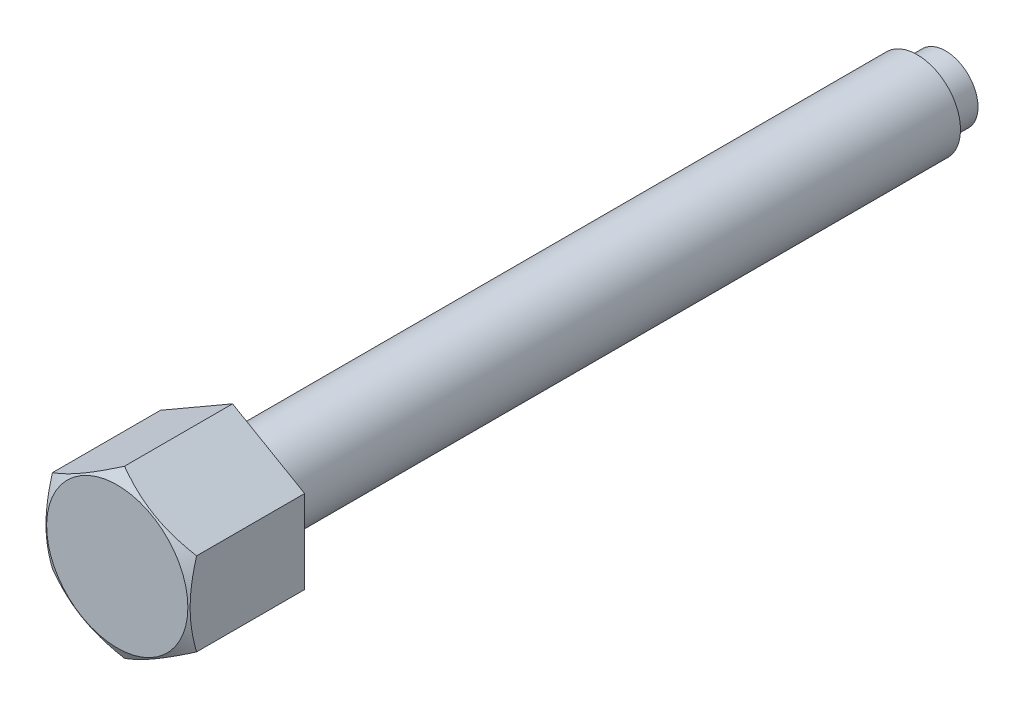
ISO-10303-21;
HEADER;
FILE_DESCRIPTION(('STEP AP214'),'2;1');
FILE_NAME('part.step','',(''),(''),'','','');
FILE_SCHEMA(('AUTOMOTIVE_DESIGN { 1 0 10303 214 1 1 1 1 }'));
ENDSEC;
DATA;
#1=APPLICATION_CONTEXT('core data for automotive mechanical design processes');
#2=APPLICATION_PROTOCOL_DEFINITION('international standard','automotive_design',2000,#1);
#3=PRODUCT_CONTEXT('',#1,'mechanical');
#4=PRODUCT('Part','Part','',(#3));
#5=PRODUCT_RELATED_PRODUCT_CATEGORY('part','',(#4));
#6=PRODUCT_DEFINITION_FORMATION('','',#4);
#7=PRODUCT_DEFINITION_CONTEXT('part definition',#1,'design');
#8=PRODUCT_DEFINITION('design','',#6,#7);
#9=PRODUCT_DEFINITION_SHAPE('','',#8);
#10=(LENGTH_UNIT() NAMED_UNIT(*) SI_UNIT(.MILLI.,.METRE.));
#11=(NAMED_UNIT(*) PLANE_ANGLE_UNIT() SI_UNIT($,.RADIAN.));
#12=(NAMED_UNIT(*) SI_UNIT($,.STERADIAN.) SOLID_ANGLE_UNIT());
#13=UNCERTAINTY_MEASURE_WITH_UNIT(LENGTH_MEASURE(1.E-05),#10,'distance_accuracy_value','');
#14=(GEOMETRIC_REPRESENTATION_CONTEXT(3) GLOBAL_UNCERTAINTY_ASSIGNED_CONTEXT((#13)) GLOBAL_UNIT_ASSIGNED_CONTEXT((#10,
#11,#12)) REPRESENTATION_CONTEXT('',''));
#15=CARTESIAN_POINT('',(0.,0.,0.));
#16=DIRECTION('',(0.,0.,1.));
#17=DIRECTION('',(1.,0.,0.));
#18=AXIS2_PLACEMENT_3D('',#15,#16,#17);
#19=CARTESIAN_POINT('',(0.,5.77350269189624,48.));
#20=DIRECTION('',(-0.5,-0.86602540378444,0.));
#21=DIRECTION('',(0.86602540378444,-0.5,0.));
#22=AXIS2_PLACEMENT_3D('',#19,#20,#21);
#23=PLANE('',#22);
#24=CARTESIAN_POINT('',(5.0002,2.88663587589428,57.4956163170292));
#25=CARTESIAN_POINT('',(4.78046540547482,3.01349970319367,57.5688784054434));
#26=CARTESIAN_POINT('',(4.55885141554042,3.14144859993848,57.635513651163));
#27=CARTESIAN_POINT('',(4.11178600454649,3.3995619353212,57.7518259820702));
#28=CARTESIAN_POINT('',(3.88632664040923,3.52973095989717,57.8014619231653));
#29=CARTESIAN_POINT('',(3.43816769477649,3.78847564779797,57.8787139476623));
#30=CARTESIAN_POINT('',(3.21553790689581,3.91701101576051,57.9068445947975));
#31=CARTESIAN_POINT('',(2.88081009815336,4.11026620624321,57.9320700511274));
#32=CARTESIAN_POINT('',(2.76915780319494,4.1747286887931,57.9376515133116));
#33=CARTESIAN_POINT('',(2.5457500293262,4.30371322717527,57.9430627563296));
#34=CARTESIAN_POINT('',(2.43399455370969,4.36823528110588,57.9428927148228));
#35=CARTESIAN_POINT('',(2.12781576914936,4.54500768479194,57.934511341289));
#36=CARTESIAN_POINT('',(1.93349391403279,4.65719946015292,57.9204352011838));
#37=CARTESIAN_POINT('',(1.5461398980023,4.8808384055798,57.8757997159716));
#38=CARTESIAN_POINT('',(1.35310909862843,4.99228478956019,57.8452251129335));
#39=CARTESIAN_POINT('',(0.96497465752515,5.21637431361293,57.7687964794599));
#40=CARTESIAN_POINT('',(0.769920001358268,5.32898917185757,57.7226185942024));
#41=CARTESIAN_POINT('',(0.382719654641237,5.55253939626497,57.6178131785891));
#42=CARTESIAN_POINT('',(0.19056900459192,5.6634776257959,57.5592102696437));
#43=CARTESIAN_POINT('',(-0.000199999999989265,5.77361816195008,57.4956163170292));
#44=B_SPLINE_CURVE_WITH_KNOTS('',3,(#24,#25,#26,#27,#28,#29,#30,#31,#32,#33,#34,#35,#36,#37,#38,
#39,#40,#41,#42,#43),.UNSPECIFIED.,.F.,.F.,(4,2,2,2,2,2,2,2,2,4),(0.,0.792555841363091,
1.58701660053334,2.36181537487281,2.74884076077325,3.13585419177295,3.80962362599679,
4.48401723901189,5.17336882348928,5.86136694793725),.UNSPECIFIED.);
#45=CARTESIAN_POINT('',(5.,2.88675134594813,57.4956829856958));
#46=VERTEX_POINT('',#45);
#47=CARTESIAN_POINT('',(0.,5.77350269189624,57.4956829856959));
#48=VERTEX_POINT('',#47);
#49=EDGE_CURVE('E29',#46,#48,#44,.T.);
#50=ORIENTED_EDGE('',*,*,#49,.F.);
#51=DIRECTION('',(0.,0.,1.));
#52=VECTOR('',#51,1.);
#53=CARTESIAN_POINT('',(5.,2.88675134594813,48.));
#54=LINE('',#53,#52);
#55=CARTESIAN_POINT('',(5.,2.88675134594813,50.));
#56=VERTEX_POINT('',#55);
#57=EDGE_CURVE('E96',#56,#46,#54,.T.);
#58=ORIENTED_EDGE('',*,*,#57,.F.);
#59=DIRECTION('',(0.86602540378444,-0.5,0.));
#60=VECTOR('',#59,1.);
#61=CARTESIAN_POINT('',(4.75,3.03108891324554,50.));
#62=LINE('',#61,#60);
#63=CARTESIAN_POINT('',(0.,5.77350269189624,50.));
#64=VERTEX_POINT('',#63);
#65=EDGE_CURVE('E110',#64,#56,#62,.T.);
#66=ORIENTED_EDGE('',*,*,#65,.F.);
#67=DIRECTION('',(0.,0.,1.));
#68=VECTOR('',#67,1.);
#69=CARTESIAN_POINT('',(0.,5.77350269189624,48.));
#70=LINE('',#69,#68);
#71=EDGE_CURVE('E36',#64,#48,#70,.T.);
#72=ORIENTED_EDGE('',*,*,#71,.T.);
#73=EDGE_LOOP('',(#50,#58,#66,#72));
#74=FACE_BOUND('',#73,.T.);
#75=ADVANCED_FACE('F14',(#74),#23,.F.);
#76=CARTESIAN_POINT('',(5.,2.88675134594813,48.));
#77=DIRECTION('',(-1.,0.,0.));
#78=DIRECTION('',(0.,-1.,0.));
#79=AXIS2_PLACEMENT_3D('',#76,#77,#78);
#80=PLANE('',#79);
#81=CARTESIAN_POINT('',(5.,-7.7556649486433,55.5014046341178));
#82=CARTESIAN_POINT('',(5.,-7.53727132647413,55.6073511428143));
#83=CARTESIAN_POINT('',(5.,-7.31837653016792,55.7122822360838));
#84=CARTESIAN_POINT('',(5.,-6.87931808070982,55.9195425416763));
#85=CARTESIAN_POINT('',(5.,-6.65915423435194,56.0218713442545));
#86=CARTESIAN_POINT('',(5.,-6.21615753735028,56.2238705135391));
#87=CARTESIAN_POINT('',(5.,-5.99331668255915,56.3235233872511));
#88=CARTESIAN_POINT('',(5.,-5.54586311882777,56.5187530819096));
#89=CARTESIAN_POINT('',(5.,-5.32125049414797,56.6143300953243));
#90=CARTESIAN_POINT('',(5.,-4.86263639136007,56.8033238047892));
#91=CARTESIAN_POINT('',(5.,-4.62856521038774,56.8965722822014));
#92=CARTESIAN_POINT('',(5.,-4.15768485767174,57.0760154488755));
#93=CARTESIAN_POINT('',(5.,-3.92087538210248,57.1622093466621));
#94=CARTESIAN_POINT('',(5.,-3.44458453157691,57.3252817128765));
#95=CARTESIAN_POINT('',(5.,-3.20510967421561,57.4021790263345));
#96=CARTESIAN_POINT('',(5.,-2.72272470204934,57.5441916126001));
#97=CARTESIAN_POINT('',(5.,-2.47981569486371,57.6093105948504));
#98=CARTESIAN_POINT('',(5.,-1.99177570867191,57.7242951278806));
#99=CARTESIAN_POINT('',(5.,-1.74666462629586,57.7742435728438));
#100=CARTESIAN_POINT('',(5.,-1.25339248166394,57.8560658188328));
#101=CARTESIAN_POINT('',(5.,-1.00523171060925,57.8879413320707));
#102=CARTESIAN_POINT('',(5.,-0.510341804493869,57.930657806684));
#103=CARTESIAN_POINT('',(5.,-0.263636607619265,57.9417692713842));
#104=CARTESIAN_POINT('',(5.,0.229835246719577,57.9427276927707));
#105=CARTESIAN_POINT('',(5.,0.476601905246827,57.9325742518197));
#106=CARTESIAN_POINT('',(5.,0.895493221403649,57.8980071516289));
#107=CARTESIAN_POINT('',(5.,1.06806584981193,57.8787113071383));
#108=CARTESIAN_POINT('',(5.,1.41194125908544,57.8309199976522));
#109=CARTESIAN_POINT('',(5.,1.58324386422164,57.8024232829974));
#110=CARTESIAN_POINT('',(5.,2.09502251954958,57.7046302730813));
#111=CARTESIAN_POINT('',(5.,2.43317693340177,57.6230490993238));
#112=CARTESIAN_POINT('',(5.,2.93880737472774,57.4816698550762));
#113=CARTESIAN_POINT('',(5.,3.10890661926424,57.4307198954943));
#114=CARTESIAN_POINT('',(5.,3.44745254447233,57.3235493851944));
#115=CARTESIAN_POINT('',(5.,3.6158992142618,57.2673287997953));
#116=CARTESIAN_POINT('',(5.,3.95119374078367,57.1505174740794));
#117=CARTESIAN_POINT('',(5.,4.11804210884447,57.0899281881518));
#118=CARTESIAN_POINT('',(5.,4.45035792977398,56.9650901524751));
#119=CARTESIAN_POINT('',(5.,4.61582539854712,56.9008414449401));
#120=CARTESIAN_POINT('',(5.,5.00518437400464,56.7454924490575));
#121=CARTESIAN_POINT('',(5.,5.22855429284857,56.6530873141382));
#122=CARTESIAN_POINT('',(5.,5.67340187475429,56.4638164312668));
#123=CARTESIAN_POINT('',(5.,5.89487942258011,56.3669504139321));
#124=CARTESIAN_POINT('',(5.,6.33628937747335,56.169651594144));
#125=CARTESIAN_POINT('',(5.,6.55622146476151,56.0692180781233));
#126=CARTESIAN_POINT('',(5.,6.99475894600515,55.8654908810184));
#127=CARTESIAN_POINT('',(5.,7.21336431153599,55.7621971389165));
#128=CARTESIAN_POINT('',(5.,7.8679853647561,55.4486366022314));
#129=CARTESIAN_POINT('',(5.,8.30233903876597,55.2349021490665));
#130=CARTESIAN_POINT('',(5.,9.16784168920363,54.8012084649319));
#131=CARTESIAN_POINT('',(5.,9.59899104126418,54.5812499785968));
#132=CARTESIAN_POINT('',(5.,10.4230640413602,54.1554511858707));
#133=CARTESIAN_POINT('',(5.,10.8161718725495,53.9499666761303));
#134=CARTESIAN_POINT('',(5.,11.6009227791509,53.5361908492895));
#135=CARTESIAN_POINT('',(5.,11.9925658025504,53.3278994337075));
#136=CARTESIAN_POINT('',(5.,12.7737356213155,52.9096956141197));
#137=CARTESIAN_POINT('',(5.,13.1632652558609,52.6997885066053));
#138=CARTESIAN_POINT('',(5.,13.9413871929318,52.2782942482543));
#139=CARTESIAN_POINT('',(5.,14.3299795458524,52.0667071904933));
#140=CARTESIAN_POINT('',(5.,14.7182266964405,51.8544931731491));
#141=B_SPLINE_CURVE_WITH_KNOTS('',3,(#81,#82,#83,#84,#85,#86,#87,#88,#89,#90,#91,#92,#93,#94,
#95,#96,#97,#98,#99,#100,#101,#102,#103,#104,#105,#106,#107,#108,#109,#110,#111,#112,#113,#114,
#115,#116,#117,#118,#119,#120,#121,#122,#123,#124,#125,#126,#127,#128,#129,#130,#131,#132,#133,
#134,#135,#136,#137,#138,#139,#140),.UNSPECIFIED.,.F.,.F.,(4,2,2,2,2,2,2,2,2,2,2,2,2,2,2,2,2,2,
2,2,2,2,2,2,2,2,2,2,2,4),(0.,0.728214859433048,1.45654367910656,2.18883515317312,
2.92109200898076,3.67688862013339,4.43276991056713,5.1870923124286,5.9411767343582,
6.69106335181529,7.44087891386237,8.18085626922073,8.92084746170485,9.44153897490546,
9.96230123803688,11.0044030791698,11.5370559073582,12.0697122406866,12.6021920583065,
13.1346657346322,13.8597869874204,14.5849520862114,15.3102630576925,16.0355895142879,
17.487780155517,18.939797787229,20.2705039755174,21.6012569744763,22.9287120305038,
24.2560940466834),.UNSPECIFIED.);
#142=CARTESIAN_POINT('',(5.,-2.88675134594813,57.4956829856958));
#143=VERTEX_POINT('',#142);
#144=EDGE_CURVE('E156',#143,#46,#141,.T.);
#145=ORIENTED_EDGE('',*,*,#144,.F.);
#146=DIRECTION('',(0.,0.,1.));
#147=VECTOR('',#146,1.);
#148=CARTESIAN_POINT('',(5.,-2.88675134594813,48.));
#149=LINE('',#148,#147);
#150=CARTESIAN_POINT('',(5.,-2.88675134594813,50.));
#151=VERTEX_POINT('',#150);
#152=EDGE_CURVE('E93',#151,#143,#149,.T.);
#153=ORIENTED_EDGE('',*,*,#152,.F.);
#154=DIRECTION('',(0.,-1.,0.));
#155=VECTOR('',#154,1.);
#156=CARTESIAN_POINT('',(5.,0.,50.));
#157=LINE('',#156,#155);
#158=EDGE_CURVE('E107',#56,#151,#157,.T.);
#159=ORIENTED_EDGE('',*,*,#158,.F.);
#160=ORIENTED_EDGE('',*,*,#57,.T.);
#161=EDGE_LOOP('',(#145,#153,#159,#160));
#162=FACE_BOUND('',#161,.T.);
#163=ADVANCED_FACE('F136',(#162),#80,.F.);
#164=CARTESIAN_POINT('',(0.,-5.77350269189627,48.));
#165=DIRECTION('',(0.5,-0.866025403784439,0.));
#166=DIRECTION('',(0.866025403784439,0.5,0.));
#167=AXIS2_PLACEMENT_3D('',#164,#165,#166);
#168=PLANE('',#167);
#169=ORIENTED_EDGE('',*,*,#152,.T.);
#170=CARTESIAN_POINT('',(5.0002,-2.88663587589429,57.4956163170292));
#171=CARTESIAN_POINT('',(4.78046540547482,-3.01349970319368,57.5688784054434));
#172=CARTESIAN_POINT('',(4.55885141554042,-3.14144859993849,57.635513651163));
#173=CARTESIAN_POINT('',(4.11178600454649,-3.39956193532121,57.7518259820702));
#174=CARTESIAN_POINT('',(3.88632664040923,-3.52973095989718,57.8014619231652));
#175=CARTESIAN_POINT('',(3.43816769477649,-3.78847564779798,57.8787139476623));
#176=CARTESIAN_POINT('',(3.21553790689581,-3.91701101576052,57.9068445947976));
#177=CARTESIAN_POINT('',(2.88081009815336,-4.11026620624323,57.9320700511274));
#178=CARTESIAN_POINT('',(2.76915780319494,-4.17472868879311,57.9376515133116));
#179=CARTESIAN_POINT('',(2.5457500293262,-4.30371322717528,57.9430627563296));
#180=CARTESIAN_POINT('',(2.43399455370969,-4.36823528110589,57.9428927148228));
#181=CARTESIAN_POINT('',(2.12781576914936,-4.54500768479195,57.934511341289));
#182=CARTESIAN_POINT('',(1.93349391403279,-4.65719946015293,57.9204352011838));
#183=CARTESIAN_POINT('',(1.54613989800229,-4.88083840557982,57.8757997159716));
#184=CARTESIAN_POINT('',(1.35310909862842,-4.99228478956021,57.8452251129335));
#185=CARTESIAN_POINT('',(0.964974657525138,-5.21637431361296,57.7687964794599));
#186=CARTESIAN_POINT('',(0.769920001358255,-5.3289891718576,57.7226185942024));
#187=CARTESIAN_POINT('',(0.38271965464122,-5.55253939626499,57.6178131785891));
#188=CARTESIAN_POINT('',(0.190569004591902,-5.66347762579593,57.5592102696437));
#189=CARTESIAN_POINT('',(-0.000200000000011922,-5.77361816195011,57.4956163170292));
#190=B_SPLINE_CURVE_WITH_KNOTS('',3,(#170,#171,#172,#173,#174,#175,#176,#177,#178,#179,#180,
#181,#182,#183,#184,#185,#186,#187,#188,#189),.UNSPECIFIED.,.F.,.F.,(4,2,2,2,2,2,2,2,2,4),(0.,
0.79255584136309,1.58701660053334,2.36181537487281,2.74884076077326,3.13585419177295,
3.8096236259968,4.4840172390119,5.1733688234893,5.86136694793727),.UNSPECIFIED.);
#191=CARTESIAN_POINT('',(0.,-5.77350269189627,57.4956829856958));
#192=VERTEX_POINT('',#191);
#193=EDGE_CURVE('E162',#143,#192,#190,.T.);
#194=ORIENTED_EDGE('',*,*,#193,.T.);
#195=DIRECTION('',(0.,0.,1.));
#196=VECTOR('',#195,1.);
#197=CARTESIAN_POINT('',(0.,-5.77350269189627,48.));
#198=LINE('',#197,#196);
#199=CARTESIAN_POINT('',(0.,-5.77350269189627,50.));
#200=VERTEX_POINT('',#199);
#201=EDGE_CURVE('E86',#200,#192,#198,.T.);
#202=ORIENTED_EDGE('',*,*,#201,.F.);
#203=DIRECTION('',(0.866025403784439,0.5,0.));
#204=VECTOR('',#203,1.);
#205=CARTESIAN_POINT('',(4.75,-3.03108891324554,50.));
#206=LINE('',#205,#204);
#207=EDGE_CURVE('E105',#200,#151,#206,.T.);
#208=ORIENTED_EDGE('',*,*,#207,.T.);
#209=EDGE_LOOP('',(#169,#194,#202,#208));
#210=FACE_BOUND('',#209,.T.);
#211=ADVANCED_FACE('F142',(#210),#168,.T.);
#212=CARTESIAN_POINT('',(0.,-5.77350269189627,48.));
#213=DIRECTION('',(0.5,0.866025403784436,0.));
#214=DIRECTION('',(-0.866025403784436,0.5,0.));
#215=AXIS2_PLACEMENT_3D('',#212,#213,#214);
#216=PLANE('',#215);
#217=CARTESIAN_POINT('',(-5.0002,-2.8866358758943,57.4956163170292));
#218=CARTESIAN_POINT('',(-4.78046540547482,-3.01349970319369,57.5688784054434));
#219=CARTESIAN_POINT('',(-4.55885141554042,-3.1414485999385,57.6355136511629));
#220=CARTESIAN_POINT('',(-4.11178600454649,-3.39956193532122,57.7518259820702));
#221=CARTESIAN_POINT('',(-3.88632664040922,-3.52973095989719,57.8014619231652));
#222=CARTESIAN_POINT('',(-3.43816769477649,-3.78847564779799,57.8787139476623));
#223=CARTESIAN_POINT('',(-3.21553790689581,-3.91701101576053,57.9068445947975));
#224=CARTESIAN_POINT('',(-2.88081009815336,-4.11026620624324,57.9320700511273));
#225=CARTESIAN_POINT('',(-2.76915780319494,-4.17472868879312,57.9376515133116));
#226=CARTESIAN_POINT('',(-2.5457500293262,-4.30371322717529,57.9430627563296));
#227=CARTESIAN_POINT('',(-2.43399455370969,-4.3682352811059,57.9428927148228));
#228=CARTESIAN_POINT('',(-2.12781576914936,-4.54500768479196,57.934511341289));
#229=CARTESIAN_POINT('',(-1.93349391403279,-4.65719946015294,57.9204352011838));
#230=CARTESIAN_POINT('',(-1.5461398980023,-4.88083840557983,57.8757997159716));
#231=CARTESIAN_POINT('',(-1.35310909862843,-4.99228478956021,57.8452251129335));
#232=CARTESIAN_POINT('',(-0.964974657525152,-5.21637431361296,57.7687964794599));
#233=CARTESIAN_POINT('',(-0.769920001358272,-5.3289891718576,57.7226185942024));
#234=CARTESIAN_POINT('',(-0.382719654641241,-5.55253939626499,57.6178131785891));
#235=CARTESIAN_POINT('',(-0.190569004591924,-5.66347762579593,57.5592102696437));
#236=CARTESIAN_POINT('',(0.000199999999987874,-5.77361816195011,57.4956163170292));
#237=B_SPLINE_CURVE_WITH_KNOTS('',3,(#217,#218,#219,#220,#221,#222,#223,#224,#225,#226,#227,
#228,#229,#230,#231,#232,#233,#234,#235,#236),.UNSPECIFIED.,.F.,.F.,(4,2,2,2,2,2,2,2,2,4),(0.,
0.792555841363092,1.58701660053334,2.36181537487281,2.74884076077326,3.13585419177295,
3.80962362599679,4.48401723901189,5.17336882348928,5.86136694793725),.UNSPECIFIED.);
#238=CARTESIAN_POINT('',(-5.,-2.88675134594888,57.4956829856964));
#239=VERTEX_POINT('',#238);
#240=EDGE_CURVE('E80',#239,#192,#237,.T.);
#241=ORIENTED_EDGE('',*,*,#240,.F.);
#242=DIRECTION('',(0.,0.,1.));
#243=VECTOR('',#242,1.);
#244=CARTESIAN_POINT('',(-5.,-2.88675134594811,48.));
#245=LINE('',#244,#243);
#246=CARTESIAN_POINT('',(-5.,-2.88675134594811,50.));
#247=VERTEX_POINT('',#246);
#248=EDGE_CURVE('E79',#247,#239,#245,.T.);
#249=ORIENTED_EDGE('',*,*,#248,.F.);
#250=DIRECTION('',(-0.866025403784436,0.5,0.));
#251=VECTOR('',#250,1.);
#252=CARTESIAN_POINT('',(-0.250000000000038,-5.62916512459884,50.));
#253=LINE('',#252,#251);
#254=EDGE_CURVE('E102',#200,#247,#253,.T.);
#255=ORIENTED_EDGE('',*,*,#254,.F.);
#256=ORIENTED_EDGE('',*,*,#201,.T.);
#257=EDGE_LOOP('',(#241,#249,#255,#256));
#258=FACE_BOUND('',#257,.T.);
#259=ADVANCED_FACE('F238',(#258),#216,.F.);
#260=CARTESIAN_POINT('',(-5.,2.88675134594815,48.));
#261=DIRECTION('',(-1.,0.,0.));
#262=DIRECTION('',(0.,-1.,0.));
#263=AXIS2_PLACEMENT_3D('',#260,#261,#262);
#264=PLANE('',#263);
#265=ORIENTED_EDGE('',*,*,#248,.T.);
#266=CARTESIAN_POINT('',(-5.,-7.75566494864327,55.5014046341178));
#267=CARTESIAN_POINT('',(-5.,-7.5372713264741,55.6073511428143));
#268=CARTESIAN_POINT('',(-5.,-7.31837653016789,55.7122822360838));
#269=CARTESIAN_POINT('',(-5.,-6.8793180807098,55.9195425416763));
#270=CARTESIAN_POINT('',(-5.,-6.65915423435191,56.0218713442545));
#271=CARTESIAN_POINT('',(-5.,-6.21615753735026,56.2238705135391));
#272=CARTESIAN_POINT('',(-5.,-5.99331668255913,56.3235233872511));
#273=CARTESIAN_POINT('',(-5.,-5.54586311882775,56.5187530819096));
#274=CARTESIAN_POINT('',(-5.,-5.32125049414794,56.6143300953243));
#275=CARTESIAN_POINT('',(-5.,-4.86263639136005,56.8033238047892));
#276=CARTESIAN_POINT('',(-5.,-4.62856521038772,56.8965722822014));
#277=CARTESIAN_POINT('',(-5.,-4.15768485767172,57.0760154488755));
#278=CARTESIAN_POINT('',(-5.,-3.92087538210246,57.1622093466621));
#279=CARTESIAN_POINT('',(-5.,-3.44458453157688,57.3252817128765));
#280=CARTESIAN_POINT('',(-5.,-3.20510967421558,57.4021790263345));
#281=CARTESIAN_POINT('',(-5.,-2.72272470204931,57.5441916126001));
#282=CARTESIAN_POINT('',(-5.,-2.47981569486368,57.6093105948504));
#283=CARTESIAN_POINT('',(-5.,-1.9917757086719,57.7242951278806));
#284=CARTESIAN_POINT('',(-5.,-1.74666462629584,57.7742435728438));
#285=CARTESIAN_POINT('',(-5.,-1.25339248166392,57.8560658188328));
#286=CARTESIAN_POINT('',(-5.,-1.00523171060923,57.8879413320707));
#287=CARTESIAN_POINT('',(-5.,-0.510341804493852,57.930657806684));
#288=CARTESIAN_POINT('',(-5.,-0.26363660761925,57.9417692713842));
#289=CARTESIAN_POINT('',(-5.,0.229835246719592,57.9427276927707));
#290=CARTESIAN_POINT('',(-5.,0.476601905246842,57.9325742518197));
#291=CARTESIAN_POINT('',(-5.,0.895493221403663,57.8980071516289));
#292=CARTESIAN_POINT('',(-5.,1.06806584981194,57.8787113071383));
#293=CARTESIAN_POINT('',(-5.,1.41194125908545,57.8309199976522));
#294=CARTESIAN_POINT('',(-5.,1.58324386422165,57.8024232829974));
#295=CARTESIAN_POINT('',(-5.,2.0950225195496,57.7046302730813));
#296=CARTESIAN_POINT('',(-5.,2.43317693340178,57.6230490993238));
#297=CARTESIAN_POINT('',(-5.,2.93880737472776,57.4816698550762));
#298=CARTESIAN_POINT('',(-5.,3.10890661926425,57.4307198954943));
#299=CARTESIAN_POINT('',(-5.,3.44745254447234,57.3235493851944));
#300=CARTESIAN_POINT('',(-5.,3.61589921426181,57.2673287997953));
#301=CARTESIAN_POINT('',(-5.,3.95119374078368,57.1505174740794));
#302=CARTESIAN_POINT('',(-5.,4.11804210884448,57.0899281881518));
#303=CARTESIAN_POINT('',(-5.,4.450357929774,56.9650901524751));
#304=CARTESIAN_POINT('',(-5.,4.61582539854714,56.9008414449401));
#305=CARTESIAN_POINT('',(-5.,5.00518437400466,56.7454924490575));
#306=CARTESIAN_POINT('',(-5.,5.22855429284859,56.6530873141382));
#307=CARTESIAN_POINT('',(-5.,5.67340187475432,56.4638164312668));
#308=CARTESIAN_POINT('',(-5.,5.89487942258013,56.3669504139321));
#309=CARTESIAN_POINT('',(-5.,6.33628937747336,56.169651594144));
#310=CARTESIAN_POINT('',(-5.,6.55622146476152,56.0692180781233));
#311=CARTESIAN_POINT('',(-5.,6.99475894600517,55.8654908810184));
#312=CARTESIAN_POINT('',(-5.,7.21336431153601,55.7621971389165));
#313=CARTESIAN_POINT('',(-5.,7.86798536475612,55.4486366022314));
#314=CARTESIAN_POINT('',(-5.,8.30233903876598,55.2349021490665));
#315=CARTESIAN_POINT('',(-5.,9.16784168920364,54.8012084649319));
#316=CARTESIAN_POINT('',(-5.,9.59899104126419,54.5812499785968));
#317=CARTESIAN_POINT('',(-5.,10.4230640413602,54.1554511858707));
#318=CARTESIAN_POINT('',(-5.,10.8161718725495,53.9499666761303));
#319=CARTESIAN_POINT('',(-5.,11.6009227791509,53.5361908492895));
#320=CARTESIAN_POINT('',(-5.,11.9925658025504,53.3278994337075));
#321=CARTESIAN_POINT('',(-5.,12.7737356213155,52.9096956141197));
#322=CARTESIAN_POINT('',(-5.,13.1632652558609,52.6997885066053));
#323=CARTESIAN_POINT('',(-5.,13.9413871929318,52.2782942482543));
#324=CARTESIAN_POINT('',(-5.,14.3299795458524,52.0667071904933));
#325=CARTESIAN_POINT('',(-5.,14.7182266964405,51.8544931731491));
#326=B_SPLINE_CURVE_WITH_KNOTS('',3,(#266,#267,#268,#269,#270,#271,#272,#273,#274,#275,#276,
#277,#278,#279,#280,#281,#282,#283,#284,#285,#286,#287,#288,#289,#290,#291,#292,#293,#294,#295,
#296,#297,#298,#299,#300,#301,#302,#303,#304,#305,#306,#307,#308,#309,#310,#311,#312,#313,#314,
#315,#316,#317,#318,#319,#320,#321,#322,#323,#324,#325),.UNSPECIFIED.,.F.,.F.,(4,2,2,2,2,2,2,2,
2,2,2,2,2,2,2,2,2,2,2,2,2,2,2,2,2,2,2,2,2,4),(0.,0.728214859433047,1.45654367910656,
2.18883515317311,2.92109200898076,3.67688862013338,4.43276991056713,5.18709231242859,
5.94117673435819,6.69106335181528,7.44087891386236,8.18085626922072,8.92084746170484,
9.44153897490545,9.96230123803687,11.0044030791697,11.5370559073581,12.0697122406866,
12.6021920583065,13.1346657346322,13.8597869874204,14.5849520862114,15.3102630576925,
16.0355895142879,17.487780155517,18.939797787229,20.2705039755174,21.6012569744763,
22.9287120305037,24.2560940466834),.UNSPECIFIED.);
#327=CARTESIAN_POINT('',(-5.,2.88675134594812,57.4956829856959));
#328=VERTEX_POINT('',#327);
#329=EDGE_CURVE('E67',#239,#328,#326,.T.);
#330=ORIENTED_EDGE('',*,*,#329,.T.);
#331=DIRECTION('',(0.,0.,1.));
#332=VECTOR('',#331,1.);
#333=CARTESIAN_POINT('',(-5.,2.88675134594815,48.));
#334=LINE('',#333,#332);
#335=CARTESIAN_POINT('',(-5.,2.88675134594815,50.));
#336=VERTEX_POINT('',#335);
#337=EDGE_CURVE('E76',#336,#328,#334,.T.);
#338=ORIENTED_EDGE('',*,*,#337,.F.);
#339=DIRECTION('',(0.,-1.,0.));
#340=VECTOR('',#339,1.);
#341=CARTESIAN_POINT('',(-5.,0.,50.));
#342=LINE('',#341,#340);
#343=EDGE_CURVE('E100',#336,#247,#342,.T.);
#344=ORIENTED_EDGE('',*,*,#343,.T.);
#345=EDGE_LOOP('',(#265,#330,#338,#344));
#346=FACE_BOUND('',#345,.T.);
#347=ADVANCED_FACE('F75',(#346),#264,.T.);
#348=CARTESIAN_POINT('',(0.,5.77350269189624,48.));
#349=DIRECTION('',(-0.5,0.866025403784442,0.));
#350=DIRECTION('',(-0.866025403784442,-0.5,0.));
#351=AXIS2_PLACEMENT_3D('',#348,#349,#350);
#352=PLANE('',#351);
#353=ORIENTED_EDGE('',*,*,#337,.T.);
#354=CARTESIAN_POINT('',(-5.0002,2.88663587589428,57.4956163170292));
#355=CARTESIAN_POINT('',(-4.78046540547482,3.01349970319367,57.5688784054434));
#356=CARTESIAN_POINT('',(-4.55885141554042,3.14144859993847,57.635513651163));
#357=CARTESIAN_POINT('',(-4.11178600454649,3.39956193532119,57.7518259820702));
#358=CARTESIAN_POINT('',(-3.88632664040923,3.52973095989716,57.8014619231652));
#359=CARTESIAN_POINT('',(-3.43816769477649,3.78847564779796,57.8787139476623));
#360=CARTESIAN_POINT('',(-3.21553790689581,3.9170110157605,57.9068445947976));
#361=CARTESIAN_POINT('',(-2.88081009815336,4.1102662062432,57.9320700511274));
#362=CARTESIAN_POINT('',(-2.76915780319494,4.17472868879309,57.9376515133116));
#363=CARTESIAN_POINT('',(-2.54575002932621,4.30371322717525,57.9430627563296));
#364=CARTESIAN_POINT('',(-2.43399455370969,4.36823528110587,57.9428927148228));
#365=CARTESIAN_POINT('',(-2.12781576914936,4.54500768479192,57.934511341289));
#366=CARTESIAN_POINT('',(-1.93349391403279,4.6571994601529,57.9204352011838));
#367=CARTESIAN_POINT('',(-1.54613989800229,4.88083840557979,57.8757997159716));
#368=CARTESIAN_POINT('',(-1.35310909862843,4.99228478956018,57.8452251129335));
#369=CARTESIAN_POINT('',(-0.964974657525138,5.21637431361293,57.7687964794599));
#370=CARTESIAN_POINT('',(-0.769920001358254,5.32898917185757,57.7226185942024));
#371=CARTESIAN_POINT('',(-0.382719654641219,5.55253939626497,57.6178131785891));
#372=CARTESIAN_POINT('',(-0.190569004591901,5.6634776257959,57.5592102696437));
#373=CARTESIAN_POINT('',(0.000200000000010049,5.77361816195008,57.4956163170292));
#374=B_SPLINE_CURVE_WITH_KNOTS('',3,(#354,#355,#356,#357,#358,#359,#360,#361,#362,#363,#364,
#365,#366,#367,#368,#369,#370,#371,#372,#373),.UNSPECIFIED.,.F.,.F.,(4,2,2,2,2,2,2,2,2,4),(0.,
0.792555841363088,1.58701660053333,2.3618153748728,2.74884076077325,3.13585419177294,
3.80962362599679,4.4840172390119,5.1733688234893,5.86136694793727),.UNSPECIFIED.);
#375=EDGE_CURVE('E64',#328,#48,#374,.T.);
#376=ORIENTED_EDGE('',*,*,#375,.T.);
#377=ORIENTED_EDGE('',*,*,#71,.F.);
#378=DIRECTION('',(-0.866025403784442,-0.5,0.));
#379=VECTOR('',#378,1.);
#380=CARTESIAN_POINT('',(-0.249999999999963,5.62916512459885,50.));
#381=LINE('',#380,#379);
#382=EDGE_CURVE('E84',#64,#336,#381,.T.);
#383=ORIENTED_EDGE('',*,*,#382,.T.);
#384=EDGE_LOOP('',(#353,#376,#377,#383));
#385=FACE_BOUND('',#384,.T.);
#386=ADVANCED_FACE('F82',(#385),#352,.T.);
#387=CARTESIAN_POINT('',(0.,0.,5.));
#388=DIRECTION('',(0.,0.,1.));
#389=DIRECTION('',(1.,0.,0.));
#390=AXIS2_PLACEMENT_3D('',#387,#388,#389);
#391=SPHERICAL_SURFACE('',#390,5.);
#392=CARTESIAN_POINT('',(0.,0.,0.53485722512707));
#393=DIRECTION('',(0.,0.,1.));
#394=DIRECTION('',(1.,0.,0.));
#395=AXIS2_PLACEMENT_3D('',#392,#393,#394);
#396=CIRCLE('',#395,2.25);
#397=CARTESIAN_POINT('',(2.25,0.,0.53485722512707));
#398=VERTEX_POINT('',#397);
#399=EDGE_CURVE('E9',#398,#398,#396,.T.);
#400=ORIENTED_EDGE('',*,*,#399,.F.);
#401=EDGE_LOOP('',(#400));
#402=FACE_BOUND('',#401,.T.);
#403=ADVANCED_FACE('F16',(#402),#391,.T.);
#404=CARTESIAN_POINT('',(0.,0.,110.));
#405=DIRECTION('',(0.,0.,1.));
#406=DIRECTION('',(1.,0.,0.));
#407=AXIS2_PLACEMENT_3D('',#404,#405,#406);
#408=CYLINDRICAL_SURFACE('',#407,2.25);
#409=ORIENTED_EDGE('',*,*,#399,.T.);
#410=EDGE_LOOP('',(#409));
#411=FACE_BOUND('',#410,.T.);
#412=CARTESIAN_POINT('',(0.,0.,2.5));
#413=DIRECTION('',(0.,0.,1.));
#414=DIRECTION('',(1.,0.,0.));
#415=AXIS2_PLACEMENT_3D('',#412,#413,#414);
#416=CIRCLE('',#415,2.25);
#417=CARTESIAN_POINT('',(2.25,0.,2.5));
#418=VERTEX_POINT('',#417);
#419=EDGE_CURVE('E22',#418,#418,#416,.T.);
#420=ORIENTED_EDGE('',*,*,#419,.F.);
#421=EDGE_LOOP('',(#420));
#422=FACE_BOUND('',#421,.T.);
#423=ADVANCED_FACE('F123',(#411,#422),#408,.T.);
#424=CARTESIAN_POINT('',(2.25,0.,2.5));
#425=DIRECTION('',(0.,0.,1.));
#426=DIRECTION('',(1.,0.,0.));
#427=AXIS2_PLACEMENT_3D('',#424,#425,#426);
#428=PLANE('',#427);
#429=CARTESIAN_POINT('',(0.,0.,2.5));
#430=DIRECTION('',(0.,0.,1.));
#431=DIRECTION('',(1.,0.,0.));
#432=AXIS2_PLACEMENT_3D('',#429,#430,#431);
#433=CIRCLE('',#432,3.);
#434=CARTESIAN_POINT('',(3.,0.,2.5));
#435=VERTEX_POINT('',#434);
#436=EDGE_CURVE('E116',#435,#435,#433,.T.);
#437=ORIENTED_EDGE('',*,*,#436,.F.);
#438=EDGE_LOOP('',(#437));
#439=FACE_BOUND('',#438,.T.);
#440=ORIENTED_EDGE('',*,*,#419,.T.);
#441=EDGE_LOOP('',(#440));
#442=FACE_BOUND('',#441,.T.);
#443=ADVANCED_FACE('F121',(#439,#442),#428,.F.);
#444=CARTESIAN_POINT('',(0.,0.,110.));
#445=DIRECTION('',(0.,0.,1.));
#446=DIRECTION('',(1.,0.,0.));
#447=AXIS2_PLACEMENT_3D('',#444,#445,#446);
#448=CYLINDRICAL_SURFACE('',#447,3.);
#449=CARTESIAN_POINT('',(0.,0.,50.));
#450=DIRECTION('',(0.,0.,1.));
#451=DIRECTION('',(1.,0.,0.));
#452=AXIS2_PLACEMENT_3D('',#449,#450,#451);
#453=CIRCLE('',#452,3.);
#454=CARTESIAN_POINT('',(3.,0.,50.));
#455=VERTEX_POINT('',#454);
#456=EDGE_CURVE('E113',#455,#455,#453,.T.);
#457=ORIENTED_EDGE('',*,*,#456,.F.);
#458=EDGE_LOOP('',(#457));
#459=FACE_BOUND('',#458,.T.);
#460=ORIENTED_EDGE('',*,*,#436,.T.);
#461=EDGE_LOOP('',(#460));
#462=FACE_BOUND('',#461,.T.);
#463=ADVANCED_FACE('F131',(#459,#462),#448,.T.);
#464=CARTESIAN_POINT('',(3.,0.,50.));
#465=DIRECTION('',(0.,0.,1.));
#466=DIRECTION('',(1.,0.,0.));
#467=AXIS2_PLACEMENT_3D('',#464,#465,#466);
#468=PLANE('',#467);
#469=ORIENTED_EDGE('',*,*,#382,.F.);
#470=ORIENTED_EDGE('',*,*,#65,.T.);
#471=ORIENTED_EDGE('',*,*,#158,.T.);
#472=ORIENTED_EDGE('',*,*,#207,.F.);
#473=ORIENTED_EDGE('',*,*,#254,.T.);
#474=ORIENTED_EDGE('',*,*,#343,.F.);
#475=EDGE_LOOP('',(#469,#470,#471,#472,#473,#474));
#476=FACE_BOUND('',#475,.T.);
#477=ORIENTED_EDGE('',*,*,#456,.T.);
#478=EDGE_LOOP('',(#477));
#479=FACE_BOUND('',#478,.T.);
#480=ADVANCED_FACE('F177',(#476,#479),#468,.F.);
#481=CARTESIAN_POINT('',(0.,0.,58.));
#482=DIRECTION('',(0.,0.,-1.));
#483=DIRECTION('',(-1.,0.,0.));
#484=AXIS2_PLACEMENT_3D('',#481,#482,#483);
#485=CONICAL_SURFACE('',#484,4.9,1.0471975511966);
#486=CARTESIAN_POINT('',(0.,0.,58.));
#487=DIRECTION('',(0.,0.,1.));
#488=DIRECTION('',(1.,0.,0.));
#489=AXIS2_PLACEMENT_3D('',#486,#487,#488);
#490=CIRCLE('',#489,4.9);
#491=CARTESIAN_POINT('',(4.9,0.,58.));
#492=VERTEX_POINT('',#491);
#493=EDGE_CURVE('E70',#492,#492,#490,.T.);
#494=ORIENTED_EDGE('',*,*,#493,.F.);
#495=EDGE_LOOP('',(#494));
#496=FACE_BOUND('',#495,.T.);
#497=ORIENTED_EDGE('',*,*,#49,.T.);
#498=ORIENTED_EDGE('',*,*,#375,.F.);
#499=ORIENTED_EDGE('',*,*,#329,.F.);
#500=ORIENTED_EDGE('',*,*,#240,.T.);
#501=ORIENTED_EDGE('',*,*,#193,.F.);
#502=ORIENTED_EDGE('',*,*,#144,.T.);
#503=EDGE_LOOP('',(#497,#498,#499,#500,#501,#502));
#504=FACE_BOUND('',#503,.T.);
#505=ADVANCED_FACE('F66',(#496,#504),#485,.T.);
#506=CARTESIAN_POINT('',(0.,0.,58.));
#507=DIRECTION('',(0.,0.,1.));
#508=DIRECTION('',(1.,0.,0.));
#509=AXIS2_PLACEMENT_3D('',#506,#507,#508);
#510=PLANE('',#509);
#511=ORIENTED_EDGE('',*,*,#493,.T.);
#512=EDGE_LOOP('',(#511));
#513=FACE_BOUND('',#512,.T.);
#514=ADVANCED_FACE('F173',(#513),#510,.T.);
#515=CLOSED_SHELL('',(#75,#163,#211,#259,#347,#386,#403,#423,#443,#463,#480,#505,#514));
#516=MANIFOLD_SOLID_BREP('B1',#515);
#517=ADVANCED_BREP_SHAPE_REPRESENTATION('',(#18,#516),#14);
#518=SHAPE_DEFINITION_REPRESENTATION(#9,#517);
ENDSEC;
END-ISO-10303-21;
